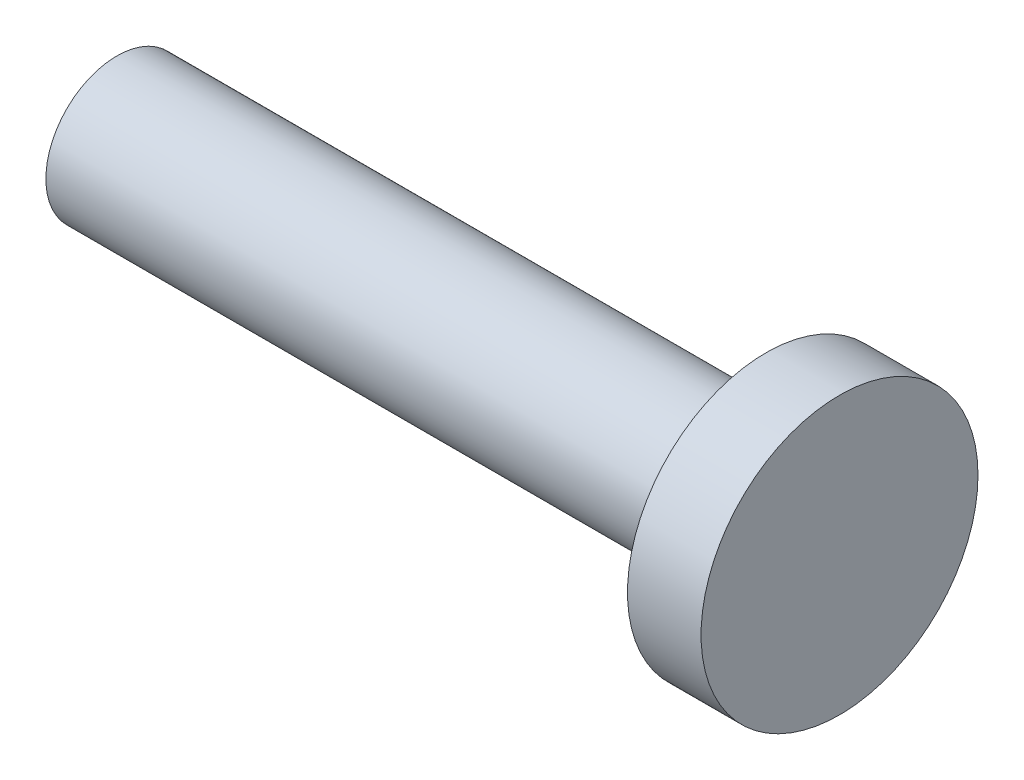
ISO-10303-21;
HEADER;
FILE_DESCRIPTION(('STEP AP214'),'2;1');
FILE_NAME('part.step','',(''),(''),'','','');
FILE_SCHEMA(('AUTOMOTIVE_DESIGN { 1 0 10303 214 1 1 1 1 }'));
ENDSEC;
DATA;
#1=APPLICATION_CONTEXT('core data for automotive mechanical design processes');
#2=APPLICATION_PROTOCOL_DEFINITION('international standard','automotive_design',2000,#1);
#3=PRODUCT_CONTEXT('',#1,'mechanical');
#4=PRODUCT('Part','Part','',(#3));
#5=PRODUCT_RELATED_PRODUCT_CATEGORY('part','',(#4));
#6=PRODUCT_DEFINITION_FORMATION('','',#4);
#7=PRODUCT_DEFINITION_CONTEXT('part definition',#1,'design');
#8=PRODUCT_DEFINITION('design','',#6,#7);
#9=PRODUCT_DEFINITION_SHAPE('','',#8);
#10=(LENGTH_UNIT() NAMED_UNIT(*) SI_UNIT(.MILLI.,.METRE.));
#11=(NAMED_UNIT(*) PLANE_ANGLE_UNIT() SI_UNIT($,.RADIAN.));
#12=(NAMED_UNIT(*) SI_UNIT($,.STERADIAN.) SOLID_ANGLE_UNIT());
#13=UNCERTAINTY_MEASURE_WITH_UNIT(LENGTH_MEASURE(1.E-05),#10,'distance_accuracy_value','');
#14=(GEOMETRIC_REPRESENTATION_CONTEXT(3) GLOBAL_UNCERTAINTY_ASSIGNED_CONTEXT((#13)) GLOBAL_UNIT_ASSIGNED_CONTEXT((#10,
#11,#12)) REPRESENTATION_CONTEXT('',''));
#15=CARTESIAN_POINT('',(0.,0.,0.));
#16=DIRECTION('',(0.,0.,1.));
#17=DIRECTION('',(1.,0.,0.));
#18=AXIS2_PLACEMENT_3D('',#15,#16,#17);
#19=CARTESIAN_POINT('',(19.0500000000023,7.105427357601E-12,-1.66533453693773E-12));
#20=DIRECTION('',(-1.00000000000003,0.,0.));
#21=DIRECTION('',(0.,0.,1.00000000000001));
#22=AXIS2_PLACEMENT_3D('',#19,#20,#21);
#23=CYLINDRICAL_SURFACE('',#22,2.085);
#24=CARTESIAN_POINT('',(19.0500000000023,7.105427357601E-12,-1.66533453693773E-12));
#25=DIRECTION('',(1.00000000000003,0.,0.));
#26=DIRECTION('',(0.,0.,-1.00000000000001));
#27=AXIS2_PLACEMENT_3D('',#24,#25,#26);
#28=CIRCLE('',#27,2.085);
#29=CARTESIAN_POINT('',(19.0500000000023,7.10527183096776E-12,-2.08500000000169));
#30=VERTEX_POINT('',#29);
#31=EDGE_CURVE('E10',#30,#30,#28,.T.);
#32=ORIENTED_EDGE('',*,*,#31,.F.);
#33=EDGE_LOOP('',(#32));
#34=FACE_BOUND('',#33,.T.);
#35=CARTESIAN_POINT('',(0.,0.,0.));
#36=DIRECTION('',(1.00000000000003,0.,0.));
#37=DIRECTION('',(0.,0.,-1.00000000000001));
#38=AXIS2_PLACEMENT_3D('',#35,#36,#37);
#39=CIRCLE('',#38,2.085);
#40=CARTESIAN_POINT('',(0.,0.,-2.08500000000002));
#41=VERTEX_POINT('',#40);
#42=EDGE_CURVE('E48',#41,#41,#39,.T.);
#43=ORIENTED_EDGE('',*,*,#42,.T.);
#44=EDGE_LOOP('',(#43));
#45=FACE_BOUND('',#44,.T.);
#46=ADVANCED_FACE('F44',(#34,#45),#23,.T.);
#47=CARTESIAN_POINT('',(0.,0.,0.));
#48=DIRECTION('',(1.00000000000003,0.,0.));
#49=DIRECTION('',(0.,0.,-1.00000000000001));
#50=AXIS2_PLACEMENT_3D('',#47,#48,#49);
#51=PLANE('',#50);
#52=ORIENTED_EDGE('',*,*,#42,.F.);
#53=EDGE_LOOP('',(#52));
#54=FACE_BOUND('',#53,.T.);
#55=ADVANCED_FACE('F74',(#54),#51,.F.);
#56=CARTESIAN_POINT('',(21.209000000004,8.88178419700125E-13,-4.9960036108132E-13));
#57=DIRECTION('',(-1.00000000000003,0.,0.));
#58=DIRECTION('',(0.,0.,1.00000000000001));
#59=AXIS2_PLACEMENT_3D('',#56,#57,#58);
#60=CYLINDRICAL_SURFACE('',#59,4.064);
#61=CARTESIAN_POINT('',(21.209000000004,8.88178419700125E-13,-4.9960036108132E-13));
#62=DIRECTION('',(1.00000000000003,0.,0.));
#63=DIRECTION('',(0.,0.,-1.00000000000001));
#64=AXIS2_PLACEMENT_3D('',#61,#62,#63);
#65=CIRCLE('',#64,4.064);
#66=CARTESIAN_POINT('',(21.209000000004,8.87875273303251E-13,-4.06400000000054));
#67=VERTEX_POINT('',#66);
#68=EDGE_CURVE('E59',#67,#67,#65,.T.);
#69=ORIENTED_EDGE('',*,*,#68,.F.);
#70=EDGE_LOOP('',(#69));
#71=FACE_BOUND('',#70,.T.);
#72=CARTESIAN_POINT('',(19.0500000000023,7.105427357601E-12,-1.66533453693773E-12));
#73=DIRECTION('',(1.00000000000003,0.,0.));
#74=DIRECTION('',(0.,0.,-1.00000000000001));
#75=AXIS2_PLACEMENT_3D('',#72,#73,#74);
#76=CIRCLE('',#75,4.064);
#77=CARTESIAN_POINT('',(19.0500000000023,7.10512421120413E-12,-4.06400000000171));
#78=VERTEX_POINT('',#77);
#79=EDGE_CURVE('E58',#78,#78,#76,.T.);
#80=ORIENTED_EDGE('',*,*,#79,.T.);
#81=EDGE_LOOP('',(#80));
#82=FACE_BOUND('',#81,.T.);
#83=ADVANCED_FACE('F72',(#71,#82),#60,.T.);
#84=CARTESIAN_POINT('',(21.209000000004,8.88178419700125E-13,-4.9960036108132E-13));
#85=DIRECTION('',(1.00000000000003,0.,0.));
#86=DIRECTION('',(0.,0.,-1.00000000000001));
#87=AXIS2_PLACEMENT_3D('',#84,#85,#86);
#88=PLANE('',#87);
#89=ORIENTED_EDGE('',*,*,#68,.T.);
#90=EDGE_LOOP('',(#89));
#91=FACE_BOUND('',#90,.T.);
#92=ADVANCED_FACE('F70',(#91),#88,.T.);
#93=CARTESIAN_POINT('',(19.0500000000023,7.105427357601E-12,-1.66533453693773E-12));
#94=DIRECTION('',(1.00000000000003,0.,0.));
#95=DIRECTION('',(0.,0.,-1.00000000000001));
#96=AXIS2_PLACEMENT_3D('',#93,#94,#95);
#97=PLANE('',#96);
#98=ORIENTED_EDGE('',*,*,#31,.T.);
#99=EDGE_LOOP('',(#98));
#100=FACE_BOUND('',#99,.T.);
#101=ORIENTED_EDGE('',*,*,#79,.F.);
#102=EDGE_LOOP('',(#101));
#103=FACE_BOUND('',#102,.T.);
#104=ADVANCED_FACE('F79',(#100,#103),#97,.F.);
#105=CLOSED_SHELL('',(#46,#55,#83,#92,#104));
#106=MANIFOLD_SOLID_BREP('B2',#105);
#107=ADVANCED_BREP_SHAPE_REPRESENTATION('',(#18,#106),#14);
#108=SHAPE_DEFINITION_REPRESENTATION(#9,#107);
ENDSEC;
END-ISO-10303-21;
